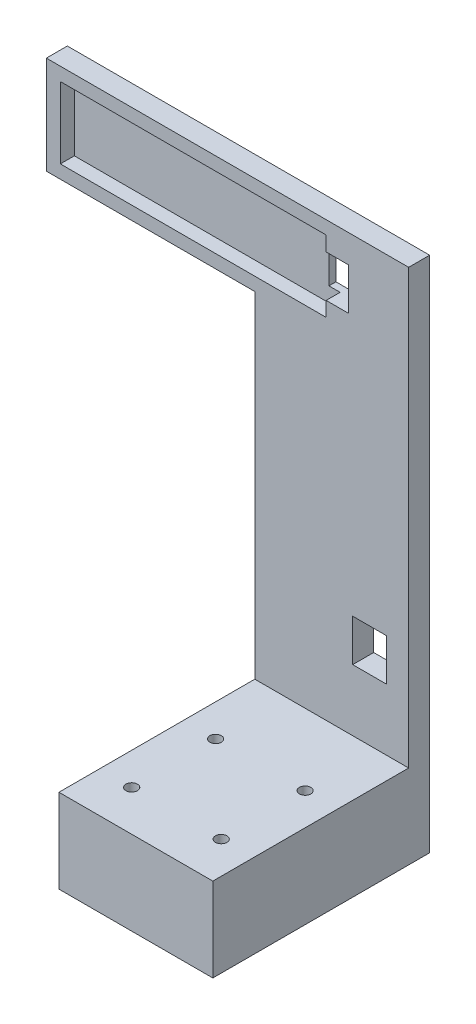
from build123d import *

# Parameters (mm, degrees)
SKETCH1_W             = 55
SKETCH1_H             = 150
BOSS_EXTRUDE1_DEPTH   = 7.5
SKETCH2_W             = 95
SKETCH2_H             = 25.5
CUT_EXTRUDE1_DEPTH    = 5
SKETCH3_W             = 55
SKETCH3_H             = 30
BOSS_EXTRUDE2_DEPTH   = 70
SKETCH5_R             = 2.05
CUT_EXTRUDE2_DEPTH    = 189.630591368
SKETCH6_W             = 45
SKETCH6_H             = 65
CUT_EXTRUDE3_DEPTH    = 25
SKETCH7_W             = 12
SKETCH7_H             = 15
CUT_EXTRUDE4_DEPTH    = 212.365205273
SKETCH8_R             = 1.55
CUT_EXTRUDE5_DEPTH    = 4
CROQUIS2_W            = 0.542735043
CROQUIS2_H            = 5.427350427
CROQUIS2_W_2          = 0.542735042
CROQUIS2_H_2          = 3.86698718
CORTAR_EXTRUIR1_DEPTH = 2


with BuildPart() as part:
    # Sketch1 → Boss-Extrude1 (new body)
    with BuildSketch(Plane.XY):
        Polygon((-74.5, 150), (0, 150), (55, 150), (55, 185), (-74.5, 185), align=None)
        with Locations((27.5, 75)):
            Rectangle(SKETCH1_W, SKETCH1_H)
    extrude(amount=BOSS_EXTRUDE1_DEPTH)

    # Sketch2 → Cut-Extrude1 (cut)
    with BuildSketch(Plane.XY.offset(7.5)):
        with Locations((-22, 167.5)):
            Rectangle(SKETCH2_W, SKETCH2_H)
    extrude(amount=-CUT_EXTRUDE1_DEPTH, mode=Mode.SUBTRACT)

    # Sketch3 → Boss-Extrude2 (add)
    with BuildSketch(Plane.XY.offset(7.5)):
        with Locations((27.5, 15)):
            Rectangle(SKETCH3_W, SKETCH3_H)
    extrude(amount=BOSS_EXTRUDE2_DEPTH)

    # Sketch5 → Cut-Extrude2 (cut, through all)
    with BuildSketch(Plane(origin=(0, 30, 0), x_dir=(1, 0, 0), z_dir=(0, 1, 0))):
        with Locations(Location((11.5, -33, 0), (0, 0, 270))):
            Circle(SKETCH5_R)
        with Locations(Location((11.5, -63, 0), (0, 0, 270))):
            Circle(SKETCH5_R)
        with Locations(Location((43.5, -63, 0), (0, 0, 270))):
            Circle(SKETCH5_R)
        with Locations(Location((43.5, -33, 0), (0, 0, 270))):
            Circle(SKETCH5_R)
    extrude(amount=-CUT_EXTRUDE2_DEPTH, mode=Mode.SUBTRACT)

    # Sketch6 → Cut-Extrude3 (cut)
    with BuildSketch(Plane.XZ):
        with Locations((27.5, 40)):
            Rectangle(SKETCH6_W, SKETCH6_H)
    extrude(amount=-CUT_EXTRUDE3_DEPTH, mode=Mode.SUBTRACT)

    # Sketch7 → Cut-Extrude4 (cut, through all)
    with BuildSketch(Plane.XY.offset(7.5)):
        with Locations((27.5, 167.5)):
            Rectangle(SKETCH7_W, SKETCH7_H)
        with Locations((41, 59.5)):
            Rectangle(SKETCH7_W, SKETCH7_H)
    extrude(amount=-CUT_EXTRUDE4_DEPTH, mode=Mode.SUBTRACT)

    # Sketch8 → Cut-Extrude5 (cut)
    with BuildSketch(Plane(origin=(0, 0, 0), x_dir=(-1, 0, 0), z_dir=(0, 0, -1))):
        with Locations((-52, 133.25)):
            Circle(SKETCH8_R)
        with Locations((-3, 132.25)):
            Circle(SKETCH8_R)
        with Locations((-18.5, 82.25)):
            Circle(SKETCH8_R)
        with Locations((-46.5, 82.25)):
            Circle(SKETCH8_R)
    extrude(amount=-CUT_EXTRUDE5_DEPTH, mode=Mode.SUBTRACT)

    # Croquis2 → Cortar-Extruir1 (cut)
    # profile 1 of 24: a face of its own
    with BuildSketch(Plane(origin=(0, 0, 0), x_dir=(-1, 0, 0), z_dir=(0, 0, -1))):
        Polygon((69.370568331, 176.166932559), (72.559136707, 176.166932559), (70.165590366, 172.774838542), (72.491294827, 172.774838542), (72.491294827, 172.29994538), (69.16704269, 172.29994538), (71.560589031, 175.692039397), (69.370568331, 175.692039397), align=None)
    # profile 2 of 24: a face of its own
    with BuildSketch(Plane(origin=(0, 0, 0), x_dir=(-1, 0, 0), z_dir=(0, 0, -1))):
        with BuildLine():
            Line((67.617915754, 173.521099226), (68.074788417, 173.299553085))
            add(Edge.make_bspline(
                [(68.074788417, 173.299553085), (68.037763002, 173.239759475), (67.96532167, 173.122771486), (67.839730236, 172.964143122), (67.709073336, 172.820258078), (67.566428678, 172.696931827), (67.41599046, 172.589255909), (67.256948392, 172.495514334), (67.089024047, 172.414636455), (66.911416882, 172.347636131), (66.723413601, 172.295436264), (66.524084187, 172.258696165), (66.312835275, 172.236103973), (66.167853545, 172.233458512), (66.093593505, 172.232103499)],
                knots=[0, 0, 0, 0, 1.069421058, 2.092354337, 3.074079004, 4.023050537, 4.955686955, 5.886197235, 6.82897851, 7.788750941, 8.771138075, 9.794142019, 10.87015348, 12, 12, 12, 12], degree=3))
            add(Edge.make_bspline(
                [(66.093593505, 172.232103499), (66.011173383, 172.233811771), (65.850757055, 172.237136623), (65.616983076, 172.266547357), (65.397048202, 172.313408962), (65.190723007, 172.380769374), (64.997977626, 172.466241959), (64.819513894, 172.572527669), (64.654169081, 172.69651105), (64.506018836, 172.839936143), (64.373621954, 172.994212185), (64.255884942, 173.153939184), (64.158160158, 173.320631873), (64.077075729, 173.491417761), (64.014021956, 173.667172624), (63.969690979, 173.847988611), (63.94067771, 174.033566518), (63.937854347, 174.159481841), (63.936433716, 174.222838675)],
                knots=[0, 0, 0, 0, 1.205491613, 2.346278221, 3.441449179, 4.491059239, 5.516244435, 6.519929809, 7.523934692, 8.53314391, 9.53017636, 10.496012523, 11.432326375, 12.352762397, 13.258695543, 14.158990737, 15.073659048, 16, 16, 16, 16], degree=3))
            add(Edge.make_bspline(
                [(63.936433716, 174.222838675), (63.937736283, 174.282282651), (63.940320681, 174.400224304), (63.964752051, 174.574352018), (64.002519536, 174.744137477), (64.057128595, 174.908592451), (64.125929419, 175.068641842), (64.211980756, 175.222581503), (64.311013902, 175.373235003), (64.388831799, 175.466610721), (64.428287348, 175.513954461)],
                knots=[0, 0, 0, 0, 1.009393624, 2.002718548, 2.981368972, 3.96092115, 4.942292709, 5.936433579, 6.953722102, 8, 8, 8, 8], degree=3))
            add(Edge.make_bspline(
                [(64.428287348, 175.513954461), (64.481187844, 175.571299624), (64.585811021, 175.684713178), (64.761625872, 175.833040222), (64.952471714, 175.956478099), (65.155413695, 176.059234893), (65.372544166, 176.137128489), (65.601624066, 176.195394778), (65.844623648, 176.227733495), (66.010820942, 176.232393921), (66.095713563, 176.234774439)],
                knots=[0, 0, 0, 0, 0.996914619, 1.971633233, 2.931517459, 3.89730572, 4.873478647, 5.874999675, 6.914562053, 8, 8, 8, 8], degree=3))
            add(Edge.make_bspline(
                [(66.095713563, 176.234774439), (66.183122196, 176.232728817), (66.354475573, 176.228718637), (66.604515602, 176.191560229), (66.841278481, 176.132589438), (67.064557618, 176.049692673), (67.27397919, 175.942032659), (67.468729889, 175.80892421), (67.651937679, 175.65428631), (67.759538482, 175.534384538), (67.814021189, 175.473673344)],
                knots=[0, 0, 0, 0, 1.078642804, 2.114540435, 3.113387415, 4.086610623, 5.048542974, 6.012925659, 6.993862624, 8, 8, 8, 8], degree=3))
            add(Edge.make_bspline(
                [(67.814021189, 175.473673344), (67.850583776, 175.428027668), (67.923323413, 175.337217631), (68.016941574, 175.189418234), (68.096543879, 175.033673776), (68.161370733, 174.869188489), (68.212375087, 174.696779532), (68.249096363, 174.515900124), (68.273286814, 174.326658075), (68.276617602, 174.197473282), (68.278314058, 174.131676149)],
                knots=[0, 0, 0, 0, 0.967473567, 1.924745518, 2.889953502, 3.858752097, 4.846970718, 5.862117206, 6.911121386, 8, 8, 8, 8], degree=3))
            Line((68.278314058, 174.131676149), (64.479168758, 174.131676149))
            add(Edge.make_bspline(
                [(64.479168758, 174.131676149), (64.481806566, 174.080719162), (64.486998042, 173.980430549), (64.510056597, 173.833480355), (64.548749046, 173.694129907), (64.599649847, 173.56190917), (64.663803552, 173.436739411), (64.741409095, 173.318558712), (64.833596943, 173.207786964), (64.937627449, 173.104848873), (65.052085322, 173.011687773), (65.173876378, 172.930192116), (65.302069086, 172.860333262), (65.437177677, 172.804295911), (65.578790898, 172.760558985), (65.727224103, 172.730285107), (65.881760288, 172.710471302), (65.987175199, 172.708165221), (66.040592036, 172.706996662)],
                knots=[0, 0, 0, 0, 1.039073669, 2.045004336, 3.02296125, 3.980111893, 4.926619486, 5.882957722, 6.854402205, 7.857159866, 8.859995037, 9.85624635, 10.83864398, 11.829261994, 12.831114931, 13.853244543, 14.912175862, 16, 16, 16, 16], degree=3))
            add(Edge.make_bspline(
                [(66.040592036, 172.706996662), (66.092930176, 172.707951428), (66.197530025, 172.709859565), (66.353134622, 172.727257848), (66.506415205, 172.756160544), (66.655876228, 172.795121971), (66.79896558, 172.842902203), (66.931516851, 172.900479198), (67.053396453, 172.964082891), (67.167251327, 173.036963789), (67.278048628, 173.125799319), (67.387838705, 173.237321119), (67.504709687, 173.369187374), (67.578749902, 173.468542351), (67.617915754, 173.521099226)],
                knots=[0, 0, 0, 0, 1.015876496, 2.030269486, 3.035340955, 4.042003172, 5.026901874, 5.961011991, 6.844769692, 7.693457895, 8.581624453, 9.595460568, 10.728044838, 12, 12, 12, 12], degree=3))
        make_face()
        with BuildLine():
            add(Edge.make_bspline(
                [(67.735579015, 174.606569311), (67.716397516, 174.669578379), (67.679419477, 174.791047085), (67.604613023, 174.95955749), (67.517921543, 175.108521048), (67.41625915, 175.238365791), (67.299770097, 175.35185072), (67.167950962, 175.454030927), (67.0177494, 175.542217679), (66.853244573, 175.618636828), (66.679172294, 175.682636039), (66.497353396, 175.726401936), (66.311499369, 175.755680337), (66.185575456, 175.758475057), (66.122214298, 175.759881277)],
                knots=[0, 0, 0, 0, 1.104466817, 2.129188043, 3.086148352, 3.990031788, 4.887356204, 5.808921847, 6.782131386, 7.80343277, 8.850085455, 9.888441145, 10.937526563, 12, 12, 12, 12], degree=3))
            add(Edge.make_bspline(
                [(66.122214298, 175.759881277), (66.070582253, 175.758948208), (65.968444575, 175.757102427), (65.818064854, 175.73988868), (65.673557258, 175.711064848), (65.534141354, 175.672151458), (65.401374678, 175.619559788), (65.272621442, 175.558312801), (65.150544, 175.483770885), (65.074101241, 175.426255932), (65.035684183, 175.397351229)],
                knots=[0, 0, 0, 0, 1.060590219, 2.098042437, 3.104680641, 4.085971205, 5.067476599, 6.035109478, 7.012525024, 8, 8, 8, 8], degree=3))
            add(Edge.make_bspline(
                [(65.035684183, 175.397351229), (65.008336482, 175.374560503), (64.95312634, 175.328550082), (64.878514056, 175.248907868), (64.806665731, 175.163509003), (64.742040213, 175.067780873), (64.681796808, 174.964375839), (64.627168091, 174.852424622), (64.574982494, 174.733526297), (64.547377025, 174.649585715), (64.533230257, 174.606569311)],
                knots=[0, 0, 0, 0, 0.898025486, 1.812953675, 2.750779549, 3.713399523, 4.724846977, 5.770194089, 6.857307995, 8, 8, 8, 8], degree=3))
            Line((64.533230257, 174.606569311), (67.735579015, 174.606569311))
        make_face(mode=Mode.SUBTRACT)
    # profile 3 of 24: a face of its own
    with BuildSketch(Plane(origin=(0, 0, 0), x_dir=(-1, 0, 0), z_dir=(0, 0, -1))):
        with BuildLine():
            Line((58.773666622, 176.166932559), (59.316401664, 176.166932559))
            Line((59.316401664, 176.166932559), (59.316401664, 175.469433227))
            add(Edge.make_bspline(
                [(59.316401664, 175.469433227), (59.369603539, 175.53271904), (59.473019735, 175.655736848), (59.644418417, 175.817498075), (59.825958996, 175.949581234), (60.015335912, 176.05648896), (60.214118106, 176.135410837), (60.420360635, 176.193566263), (60.6353415, 176.22792373), (60.781594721, 176.232473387), (60.855564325, 176.234774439)],
                knots=[0, 0, 0, 0, 1.111920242, 2.161400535, 3.161851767, 4.126104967, 5.07964332, 6.032517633, 7.00491838, 8, 8, 8, 8], degree=3))
            add(Edge.make_bspline(
                [(60.855564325, 176.234774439), (60.930296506, 176.23213322), (61.076648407, 176.226960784), (61.289979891, 176.186112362), (61.489674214, 176.116663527), (61.674505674, 176.021163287), (61.840942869, 175.902371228), (61.986967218, 175.76399039), (62.108061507, 175.604789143), (62.1887897, 175.456599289), (62.243191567, 175.325733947), (62.27549191, 175.212994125), (62.306235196, 175.088447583), (62.328067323, 174.950386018), (62.347990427, 174.799919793), (62.359431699, 174.636024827), (62.368818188, 174.459687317), (62.369127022, 174.337690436), (62.36928628, 174.274780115)],
                knots=[0, 0, 0, 0, 1.266569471, 2.480388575, 3.666522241, 4.840213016, 5.995671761, 7.122871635, 8.238500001, 9.37270005, 9.9746134, 10.638003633, 11.358784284, 12.148732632, 13.006310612, 13.931773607, 14.933474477, 16, 16, 16, 16], degree=3))
            Line((62.36928628, 174.274780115), (62.36928628, 172.29994538))
            Line((62.36928628, 172.29994538), (61.826551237, 172.29994538))
            Line((61.826551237, 172.29994538), (61.826551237, 174.118955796))
            add(Edge.make_bspline(
                [(61.826551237, 174.118955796), (61.826769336, 174.171605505), (61.827186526, 174.27231652), (61.824356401, 174.416470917), (61.822644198, 174.547219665), (61.819690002, 174.664198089), (61.814940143, 174.767339), (61.811609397, 174.85684156), (61.804978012, 174.932419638), (61.800106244, 174.978292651), (61.797930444, 174.998780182)],
                knots=[0, 0, 0, 0, 1.434747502, 2.74445729, 3.92900273, 4.998231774, 5.933055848, 6.742823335, 7.438527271, 8, 8, 8, 8], degree=3))
            add(Edge.make_bspline(
                [(61.797930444, 174.998780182), (61.793481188, 175.029605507), (61.78481931, 175.08961671), (61.763846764, 175.176105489), (61.734375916, 175.256263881), (61.700452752, 175.33164717), (61.657061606, 175.400307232), (61.607316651, 175.462893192), (61.550388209, 175.519775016), (61.464797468, 175.587887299), (61.342076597, 175.658493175), (61.17550602, 175.71775933), (60.989294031, 175.754262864), (60.858215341, 175.757955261), (60.789842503, 175.759881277)],
                knots=[0, 0, 0, 0, 0.798662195, 1.554847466, 2.277311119, 2.986925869, 3.670959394, 4.354632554, 5.033966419, 5.730377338, 7.155873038, 8.641058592, 10.247919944, 12, 12, 12, 12], degree=3))
            add(Edge.make_bspline(
                [(60.789842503, 175.759881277), (60.749169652, 175.759168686), (60.668994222, 175.757764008), (60.550181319, 175.743496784), (60.434826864, 175.719848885), (60.321797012, 175.689038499), (60.21365733, 175.644881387), (60.106759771, 175.59646468), (60.005150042, 175.534405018), (59.905859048, 175.46684983), (59.813924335, 175.390609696), (59.727987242, 175.311149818), (59.651695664, 175.226085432), (59.583648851, 175.136519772), (59.522871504, 175.043259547), (59.470607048, 174.945083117), (59.427013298, 174.842515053), (59.404860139, 174.771433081), (59.393783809, 174.735892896)],
                knots=[0, 0, 0, 0, 1.051784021, 2.073305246, 3.089701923, 4.096642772, 5.098092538, 6.108057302, 7.128555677, 8.173166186, 9.212444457, 10.214769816, 11.198544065, 12.163800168, 13.122150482, 14.074905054, 15.037474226, 16, 16, 16, 16], degree=3))
            add(Edge.make_bspline(
                [(59.393783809, 174.735892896), (59.38748338, 174.709808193), (59.373775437, 174.6530553), (59.358364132, 174.559921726), (59.34635989, 174.451925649), (59.334293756, 174.329728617), (59.326045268, 174.192539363), (59.321578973, 174.040882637), (59.316523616, 173.87447329), (59.316443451, 173.758550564), (59.316401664, 173.698124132)],
                knots=[0, 0, 0, 0, 0.617412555, 1.343314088, 2.170381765, 3.117878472, 4.168869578, 5.332398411, 6.609473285, 8, 8, 8, 8], degree=3))
            Line((59.316401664, 173.698124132), (59.316401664, 172.29994538))
            Line((59.316401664, 172.29994538), (58.773666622, 172.29994538))
            Line((58.773666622, 172.29994538), (58.773666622, 176.166932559))
        make_face()
    # profile 4 of 24: a face of its own
    with BuildSketch(Plane(origin=(0, 0, 0), x_dir=(-1, 0, 0), z_dir=(0, 0, -1))):
        with BuildLine():
            Line((61.690867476, 177.659453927), (61.962234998, 177.31176429))
            add(Edge.make_bspline(
                [(61.962234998, 177.31176429), (61.919055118, 177.281666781), (61.837093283, 177.224537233), (61.717125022, 177.150264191), (61.606982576, 177.092128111), (61.505481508, 177.048010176), (61.407153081, 177.017853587), (61.309299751, 176.996593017), (61.208914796, 176.983388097), (61.141105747, 176.981825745), (61.106791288, 176.981035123)],
                knots=[0, 0, 0, 0, 1.351868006, 2.566046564, 3.621582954, 4.548779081, 5.404257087, 6.258771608, 7.118859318, 8, 8, 8, 8], degree=3))
            add(Edge.make_bspline(
                [(61.106791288, 176.981035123), (61.061115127, 176.982445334), (60.968125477, 176.985316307), (60.828126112, 177.009852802), (60.686139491, 177.049100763), (60.593422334, 177.086132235), (60.546035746, 177.105058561)],
                knots=[0, 0, 0, 0, 0.947532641, 1.929030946, 2.941553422, 4, 4, 4, 4], degree=3))
            add(Edge.make_bspline(
                [(60.546035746, 177.105058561), (60.508990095, 177.121099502), (60.442134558, 177.150048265), (60.352698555, 177.186641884), (60.285704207, 177.213736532), (60.247531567, 177.22469851), (60.232267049, 177.229081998)],
                knots=[0, 0, 0, 0, 1.434685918, 2.589148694, 3.435827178, 4, 4, 4, 4], degree=3))
            add(Edge.make_bspline(
                [(60.232267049, 177.229081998), (60.200946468, 177.236140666), (60.136051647, 177.250765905), (60.069521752, 177.251844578), (60.035101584, 177.252402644)],
                knots=[0, 0, 0, 0, 0.965272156, 2, 2, 2, 2], degree=3))
            add(Edge.make_bspline(
                [(60.035101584, 177.252402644), (59.991867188, 177.250495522), (59.906618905, 177.246735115), (59.799879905, 177.223025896), (59.711418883, 177.189608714), (59.632316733, 177.152760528), (59.538457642, 177.106375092), (59.472734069, 177.069038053), (59.437245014, 177.048877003)],
                knots=[0, 0, 0, 0, 1.21610364, 2.397876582, 3.055264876, 3.873878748, 4.851948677, 6, 6, 6, 6], degree=3))
            Line((59.437245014, 177.048877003), (59.180717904, 177.41352711))
            add(Edge.make_bspline(
                [(59.180717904, 177.41352711), (59.21003017, 177.438360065), (59.268214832, 177.487653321), (59.36135958, 177.553105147), (59.461606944, 177.605984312), (59.565653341, 177.650700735), (59.675605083, 177.684450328), (59.78985649, 177.710720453), (59.910075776, 177.723661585), (59.991617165, 177.726072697), (60.032981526, 177.727295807)],
                knots=[0, 0, 0, 0, 0.991279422, 1.967683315, 2.930537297, 3.911190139, 4.886017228, 5.894882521, 6.932114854, 8, 8, 8, 8], degree=3))
            add(Edge.make_bspline(
                [(60.032981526, 177.727295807), (60.075488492, 177.72547803), (60.165066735, 177.721647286), (60.304652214, 177.694300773), (60.455558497, 177.650494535), (60.557992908, 177.610489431), (60.611757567, 177.589491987)],
                knots=[0, 0, 0, 0, 0.852167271, 1.795838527, 2.843103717, 4, 4, 4, 4], degree=3))
            add(Edge.make_bspline(
                [(60.611757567, 177.589491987), (60.662359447, 177.569241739), (60.756887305, 177.531412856), (60.892775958, 177.490582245), (61.011273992, 177.46192572), (61.085462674, 177.457814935), (61.11951164, 177.455928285)],
                knots=[0, 0, 0, 0, 1.238485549, 2.313577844, 3.226014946, 4, 4, 4, 4], degree=3))
            add(Edge.make_bspline(
                [(61.11951164, 177.455928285), (61.137567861, 177.456606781), (61.175670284, 177.45803855), (61.235219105, 177.468371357), (61.299689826, 177.484260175), (61.368701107, 177.506756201), (61.442384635, 177.536057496), (61.521406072, 177.570702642), (61.605206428, 177.612138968), (61.661663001, 177.643322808), (61.690867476, 177.659453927)],
                knots=[0, 0, 0, 0, 0.707737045, 1.493474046, 2.363696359, 3.309985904, 4.336436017, 5.4715575, 6.692059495, 8, 8, 8, 8], degree=3))
        make_face()
    # profile 5 of 24: a face of its own
    with BuildSketch(Plane(origin=(0, 0, 0), x_dir=(-1, 0, 0), z_dir=(0, 0, -1))):
        with BuildLine():
            Line((53.407373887, 176.166932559), (53.950108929, 176.166932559))
            Line((53.950108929, 176.166932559), (53.950108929, 174.373362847))
            add(Edge.make_bspline(
                [(53.950108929, 174.373362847), (53.950147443, 174.320709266), (53.950221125, 174.219976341), (53.955301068, 174.075122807), (53.959792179, 173.942894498), (53.967861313, 173.823338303), (53.98028512, 173.716741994), (53.991863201, 173.622780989), (54.007703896, 173.541363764), (54.021215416, 173.492058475), (54.027491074, 173.469157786)],
                knots=[0, 0, 0, 0, 1.388489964, 2.656355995, 3.822101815, 4.877729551, 5.815201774, 6.652054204, 7.373923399, 8, 8, 8, 8], degree=3))
            add(Edge.make_bspline(
                [(54.027491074, 173.469157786), (54.037528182, 173.44031076), (54.057492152, 173.382933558), (54.097148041, 173.301544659), (54.142995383, 173.224651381), (54.195206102, 173.152366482), (54.2533676, 173.084271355), (54.318756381, 173.021651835), (54.38979847, 172.962727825), (54.495037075, 172.892531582), (54.638988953, 172.81713781), (54.827621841, 172.752766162), (55.032205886, 172.713642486), (55.17355655, 172.709259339), (55.246524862, 172.706996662)],
                knots=[0, 0, 0, 0, 0.713237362, 1.418640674, 2.111118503, 2.803202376, 3.499999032, 4.200747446, 4.916513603, 5.65395606, 7.153437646, 8.699331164, 10.2961224, 12, 12, 12, 12], degree=3))
            add(Edge.make_bspline(
                [(55.246524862, 172.706996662), (55.319120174, 172.709375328), (55.459666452, 172.713980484), (55.661874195, 172.751196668), (55.846871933, 172.814249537), (56.013266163, 172.90104429), (56.159626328, 173.008005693), (56.281410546, 173.133444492), (56.381216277, 173.273797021), (56.42535955, 173.378427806), (56.447538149, 173.430996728)],
                knots=[0, 0, 0, 0, 1.164572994, 2.25464146, 3.285868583, 4.290364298, 5.255624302, 6.182035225, 7.08661253, 8, 8, 8, 8], degree=3))
            add(Edge.make_bspline(
                [(56.447538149, 173.430996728), (56.45431415, 173.452088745), (56.469257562, 173.498603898), (56.483912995, 173.578019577), (56.497610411, 173.672417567), (56.509238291, 173.782734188), (56.517102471, 173.908644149), (56.523388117, 174.050004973), (56.527857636, 174.206556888), (56.528017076, 174.316117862), (56.528100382, 174.373362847)],
                knots=[0, 0, 0, 0, 0.559844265, 1.234649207, 2.038502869, 2.973158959, 4.039089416, 5.228949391, 6.552141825, 8, 8, 8, 8], degree=3))
            Line((56.528100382, 174.373362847), (56.528100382, 176.166932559))
            Line((56.528100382, 176.166932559), (57.070835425, 176.166932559))
            Line((57.070835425, 176.166932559), (57.070835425, 174.28432038))
            add(Edge.make_bspline(
                [(57.070835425, 174.28432038), (57.070266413, 174.220352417), (57.069162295, 174.096228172), (57.059488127, 173.915880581), (57.044069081, 173.747836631), (57.021827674, 173.591789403), (56.993428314, 173.448506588), (56.960105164, 173.316726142), (56.918617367, 173.197724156), (56.87089995, 173.0894521), (56.815414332, 172.991136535), (56.75643017, 172.897848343), (56.689101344, 172.811464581), (56.616947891, 172.728913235), (56.537514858, 172.652623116), (56.450773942, 172.583076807), (56.359819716, 172.516311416), (56.260894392, 172.457326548), (56.155642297, 172.40435426), (56.044456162, 172.357122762), (55.926283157, 172.319818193), (55.802186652, 172.287457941), (55.671535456, 172.262341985), (55.534203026, 172.244423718), (55.390865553, 172.233607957), (55.293185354, 172.232611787), (55.243344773, 172.232103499)],
                knots=[0, 0, 0, 0, 1.455335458, 2.823951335, 4.107895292, 5.293730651, 6.408430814, 7.430196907, 8.383639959, 9.272568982, 10.118238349, 10.950037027, 11.781369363, 12.607241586, 13.443070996, 14.283065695, 15.135396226, 16.008145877, 16.899797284, 17.815056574, 18.753192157, 19.716447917, 20.731836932, 21.777889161, 22.866184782, 24, 24, 24, 24], degree=3))
            add(Edge.make_bspline(
                [(55.243344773, 172.232103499), (55.193149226, 172.23259541), (55.095112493, 172.23355616), (54.951092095, 172.244545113), (54.813689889, 172.262058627), (54.68248732, 172.287917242), (54.557556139, 172.319648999), (54.438252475, 172.356882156), (54.326629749, 172.404691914), (54.220601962, 172.456891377), (54.121420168, 172.517094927), (54.02832143, 172.582257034), (53.942149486, 172.6538354), (53.861986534, 172.730306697), (53.789007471, 172.813245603), (53.72197412, 172.90141589), (53.661507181, 172.995030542), (53.60644655, 173.094867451), (53.557960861, 173.204138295), (53.518517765, 173.326287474), (53.483282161, 173.460267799), (53.456555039, 173.607825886), (53.434220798, 173.767280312), (53.418637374, 173.939910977), (53.409048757, 174.125205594), (53.407944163, 174.253213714), (53.407373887, 174.319301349)],
                knots=[0, 0, 0, 0, 1.127190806, 2.201512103, 3.242001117, 4.236561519, 5.202823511, 6.136465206, 7.039972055, 7.92726535, 8.788808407, 9.64312027, 10.477364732, 11.302461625, 12.128931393, 12.955896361, 13.78798637, 14.6297467, 15.514516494, 16.468181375, 17.509547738, 18.624010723, 19.833909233, 21.125071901, 22.515741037, 24, 24, 24, 24], degree=3))
            Line((53.407373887, 174.319301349), (53.407373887, 176.166932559))
        make_face()
    # profile 6 of 24: a face of its own
    with BuildSketch(Plane(origin=(0, 0, 0), x_dir=(-1, 0, 0), z_dir=(0, 0, -1))):
        Polygon((55.515772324, 177.862979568), (56.324574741, 177.862979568), (55.21578401, 176.777509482), (54.696369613, 176.777509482), align=None)
    # profile 7 of 24: a face of its own
    with BuildSketch(Plane(origin=(0, 0, 0), x_dir=(-1, 0, 0), z_dir=(0, 0, -1))):
        Polygon((47.159136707, 172.29994538), (47.159136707, 177.591612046), (47.27361988, 177.591612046), (51.161807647, 173.493538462), (51.161807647, 177.591612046), (51.70454269, 177.591612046), (51.70454269, 172.29994538), (51.580519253, 172.29994538), (47.70187175, 176.38741867), (47.70187175, 172.29994538), align=None)
    # profile 8 of 24: a face of its own
    with BuildSketch(Plane(origin=(0, 0, 0), x_dir=(-1, 0, 0), z_dir=(0, 0, -1))):
        with Locations((42.600162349, 175.013620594)):
            Rectangle(CROQUIS2_W, CROQUIS2_H)
    # profile 9 of 24: a face of its own
    with BuildSketch(Plane(origin=(0, 0, 0), x_dir=(-1, 0, 0), z_dir=(0, 0, -1))):
        with Locations((40.55812175, 175.013620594)):
            Rectangle(CROQUIS2_W_2, CROQUIS2_H)
    # profile 10 of 24: a face of its own
    with BuildSketch(Plane(origin=(0, 0, 0), x_dir=(-1, 0, 0), z_dir=(0, 0, -1))):
        with BuildLine():
            Line((38.194892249, 173.521099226), (38.651764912, 173.299553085))
            add(Edge.make_bspline(
                [(38.651764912, 173.299553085), (38.614739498, 173.239759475), (38.542298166, 173.122771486), (38.416706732, 172.964143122), (38.286049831, 172.820258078), (38.143405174, 172.696931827), (37.992966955, 172.589255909), (37.833924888, 172.495514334), (37.666000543, 172.414636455), (37.488393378, 172.347636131), (37.300390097, 172.295436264), (37.101060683, 172.258696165), (36.889811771, 172.236103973), (36.744830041, 172.233458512), (36.67057, 172.232103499)],
                knots=[0, 0, 0, 0, 1.069421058, 2.092354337, 3.074079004, 4.023050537, 4.955686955, 5.886197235, 6.82897851, 7.788750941, 8.771138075, 9.794142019, 10.87015348, 12, 12, 12, 12], degree=3))
            add(Edge.make_bspline(
                [(36.67057, 172.232103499), (36.588149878, 172.233811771), (36.427733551, 172.237136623), (36.193959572, 172.266547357), (35.974024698, 172.313408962), (35.767699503, 172.380769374), (35.574954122, 172.466241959), (35.39649039, 172.572527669), (35.231145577, 172.69651105), (35.082995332, 172.839936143), (34.95059845, 172.994212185), (34.832861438, 173.153939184), (34.735136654, 173.320631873), (34.654052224, 173.491417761), (34.590998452, 173.667172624), (34.546667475, 173.847988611), (34.517654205, 174.033566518), (34.514830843, 174.159481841), (34.513410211, 174.222838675)],
                knots=[0, 0, 0, 0, 1.205491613, 2.346278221, 3.441449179, 4.491059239, 5.516244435, 6.519929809, 7.523934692, 8.53314391, 9.53017636, 10.496012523, 11.432326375, 12.352762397, 13.258695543, 14.158990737, 15.073659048, 16, 16, 16, 16], degree=3))
            add(Edge.make_bspline(
                [(34.513410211, 174.222838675), (34.514712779, 174.282282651), (34.517297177, 174.400224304), (34.541728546, 174.574352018), (34.579496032, 174.744137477), (34.634105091, 174.908592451), (34.702905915, 175.068641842), (34.788957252, 175.222581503), (34.887990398, 175.373235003), (34.965808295, 175.466610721), (35.005263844, 175.513954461)],
                knots=[0, 0, 0, 0, 1.009393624, 2.002718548, 2.981368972, 3.96092115, 4.942292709, 5.936433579, 6.953722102, 8, 8, 8, 8], degree=3))
            add(Edge.make_bspline(
                [(35.005263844, 175.513954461), (35.058164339, 175.571299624), (35.162787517, 175.684713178), (35.338602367, 175.833040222), (35.529448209, 175.956478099), (35.732390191, 176.059234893), (35.949520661, 176.137128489), (36.178600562, 176.195394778), (36.421600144, 176.227733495), (36.587797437, 176.232393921), (36.672690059, 176.234774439)],
                knots=[0, 0, 0, 0, 0.996914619, 1.971633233, 2.931517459, 3.89730572, 4.873478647, 5.874999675, 6.914562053, 8, 8, 8, 8], degree=3))
            add(Edge.make_bspline(
                [(36.672690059, 176.234774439), (36.760098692, 176.232728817), (36.931452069, 176.228718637), (37.181492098, 176.191560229), (37.418254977, 176.132589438), (37.641534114, 176.049692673), (37.850955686, 175.942032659), (38.045706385, 175.80892421), (38.228914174, 175.65428631), (38.336514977, 175.534384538), (38.390997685, 175.473673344)],
                knots=[0, 0, 0, 0, 1.078642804, 2.114540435, 3.113387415, 4.086610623, 5.048542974, 6.012925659, 6.993862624, 8, 8, 8, 8], degree=3))
            add(Edge.make_bspline(
                [(38.390997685, 175.473673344), (38.427560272, 175.428027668), (38.500299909, 175.337217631), (38.59391807, 175.189418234), (38.673520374, 175.033673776), (38.738347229, 174.869188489), (38.789351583, 174.696779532), (38.826072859, 174.515900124), (38.85026331, 174.326658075), (38.853594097, 174.197473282), (38.855290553, 174.131676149)],
                knots=[0, 0, 0, 0, 0.967473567, 1.924745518, 2.889953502, 3.858752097, 4.846970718, 5.862117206, 6.911121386, 8, 8, 8, 8], degree=3))
            Line((38.855290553, 174.131676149), (35.056145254, 174.131676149))
            add(Edge.make_bspline(
                [(35.056145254, 174.131676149), (35.058783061, 174.080719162), (35.063974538, 173.980430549), (35.087033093, 173.833480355), (35.125725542, 173.694129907), (35.176626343, 173.56190917), (35.240780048, 173.436739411), (35.318385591, 173.318558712), (35.410573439, 173.207786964), (35.514603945, 173.104848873), (35.629061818, 173.011687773), (35.750852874, 172.930192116), (35.879045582, 172.860333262), (36.014154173, 172.804295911), (36.155767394, 172.760558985), (36.304200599, 172.730285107), (36.458736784, 172.710471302), (36.564151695, 172.708165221), (36.617568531, 172.706996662)],
                knots=[0, 0, 0, 0, 1.039073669, 2.045004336, 3.02296125, 3.980111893, 4.926619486, 5.882957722, 6.854402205, 7.857159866, 8.859995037, 9.85624635, 10.83864398, 11.829261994, 12.831114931, 13.853244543, 14.912175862, 16, 16, 16, 16], degree=3))
            add(Edge.make_bspline(
                [(36.617568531, 172.706996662), (36.669906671, 172.707951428), (36.774506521, 172.709859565), (36.930111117, 172.727257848), (37.0833917, 172.756160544), (37.232852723, 172.795121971), (37.375942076, 172.842902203), (37.508493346, 172.900479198), (37.630372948, 172.964082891), (37.744227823, 173.036963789), (37.855025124, 173.125799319), (37.9648152, 173.237321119), (38.081686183, 173.369187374), (38.155726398, 173.468542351), (38.194892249, 173.521099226)],
                knots=[0, 0, 0, 0, 1.015876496, 2.030269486, 3.035340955, 4.042003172, 5.026901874, 5.961011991, 6.844769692, 7.693457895, 8.581624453, 9.595460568, 10.728044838, 12, 12, 12, 12], degree=3))
        make_face()
        with BuildLine():
            add(Edge.make_bspline(
                [(38.312555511, 174.606569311), (38.293374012, 174.669578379), (38.256395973, 174.791047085), (38.181589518, 174.95955749), (38.094898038, 175.108521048), (37.993235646, 175.238365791), (37.876746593, 175.35185072), (37.744927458, 175.454030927), (37.594725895, 175.542217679), (37.430221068, 175.618636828), (37.25614879, 175.682636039), (37.074329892, 175.726401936), (36.888475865, 175.755680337), (36.762551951, 175.758475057), (36.699190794, 175.759881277)],
                knots=[0, 0, 0, 0, 1.104466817, 2.129188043, 3.086148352, 3.990031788, 4.887356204, 5.808921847, 6.782131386, 7.80343277, 8.850085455, 9.888441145, 10.937526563, 12, 12, 12, 12], degree=3))
            add(Edge.make_bspline(
                [(36.699190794, 175.759881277), (36.647558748, 175.758948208), (36.545421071, 175.757102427), (36.39504135, 175.73988868), (36.250533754, 175.711064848), (36.111117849, 175.672151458), (35.978351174, 175.619559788), (35.849597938, 175.558312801), (35.727520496, 175.483770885), (35.651077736, 175.426255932), (35.612660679, 175.397351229)],
                knots=[0, 0, 0, 0, 1.060590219, 2.098042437, 3.104680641, 4.085971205, 5.067476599, 6.035109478, 7.012525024, 8, 8, 8, 8], degree=3))
            add(Edge.make_bspline(
                [(35.612660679, 175.397351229), (35.585312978, 175.374560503), (35.530102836, 175.328550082), (35.455490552, 175.248907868), (35.383642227, 175.163509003), (35.319016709, 175.067780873), (35.258773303, 174.964375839), (35.204144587, 174.852424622), (35.15195899, 174.733526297), (35.124353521, 174.649585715), (35.110206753, 174.606569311)],
                knots=[0, 0, 0, 0, 0.898025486, 1.812953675, 2.750779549, 3.713399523, 4.724846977, 5.770194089, 6.857307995, 8, 8, 8, 8], degree=3))
            Line((35.110206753, 174.606569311), (38.312555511, 174.606569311))
        make_face(mode=Mode.SUBTRACT)
    # profile 11 of 24: a face of its own
    with BuildSketch(Plane(origin=(0, 0, 0), x_dir=(-1, 0, 0), z_dir=(0, 0, -1))):
        Polygon((29.418484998, 176.166932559), (30.018461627, 176.166932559), (31.420880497, 173.411916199), (32.821179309, 176.166932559), (33.421155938, 176.166932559), (31.453741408, 172.29994538), (31.385899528, 172.29994538), align=None)
    # profile 12 of 24: a face of its own
    with BuildSketch(Plane(origin=(0, 0, 0), x_dir=(-1, 0, 0), z_dir=(0, 0, -1))):
        with BuildLine():
            Line((28.122705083, 176.166932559), (28.122705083, 172.29994538))
            Line((28.122705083, 172.29994538), (27.57997004, 172.29994538))
            Line((27.57997004, 172.29994538), (27.57997004, 172.968823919))
            add(Edge.make_bspline(
                [(27.57997004, 172.968823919), (27.522652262, 172.908053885), (27.409958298, 172.788572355), (27.220645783, 172.636254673), (27.022556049, 172.507272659), (26.813324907, 172.405202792), (26.594082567, 172.327354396), (26.365151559, 172.27300133), (26.126727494, 172.237347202), (25.964262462, 172.233868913), (25.881802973, 172.232103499)],
                knots=[0, 0, 0, 0, 1.048368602, 2.061224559, 3.043775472, 4.012553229, 4.978499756, 5.96037864, 6.964785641, 8, 8, 8, 8], degree=3))
            add(Edge.make_bspline(
                [(25.881802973, 172.232103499), (25.808217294, 172.2339421), (25.663347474, 172.237561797), (25.450146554, 172.266050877), (25.245295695, 172.311136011), (25.048443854, 172.37508181), (24.860251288, 172.458493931), (24.679566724, 172.559039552), (24.507704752, 172.679119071), (24.346284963, 172.815410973), (24.198890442, 172.964975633), (24.068305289, 173.123222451), (23.958269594, 173.290538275), (23.869127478, 173.466460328), (23.798385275, 173.64956959), (23.748606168, 173.840846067), (23.718051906, 174.039875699), (23.714687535, 174.175380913), (23.712982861, 174.244039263)],
                knots=[0, 0, 0, 0, 1.073006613, 2.112452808, 3.131537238, 4.128992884, 5.125875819, 6.129556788, 7.140358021, 8.179037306, 9.206764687, 10.199268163, 11.167014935, 12.12125937, 13.070745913, 14.024558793, 14.999075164, 16, 16, 16, 16], degree=3))
            add(Edge.make_bspline(
                [(23.712982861, 174.244039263), (23.714586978, 174.311301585), (23.71776197, 174.444432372), (23.749957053, 174.639763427), (23.799658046, 174.828208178), (23.869776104, 175.00898322), (23.960755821, 175.181962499), (24.072205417, 175.34706686), (24.202767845, 175.505477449), (24.352771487, 175.65320315), (24.515466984, 175.78930213), (24.68886267, 175.908175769), (24.869681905, 176.0101097), (25.059853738, 176.091440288), (25.257171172, 176.156763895), (25.463140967, 176.20228968), (25.677219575, 176.228948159), (25.822719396, 176.232811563), (25.896643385, 176.234774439)],
                knots=[0, 0, 0, 0, 0.982608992, 1.944855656, 2.885902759, 3.827956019, 4.773021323, 5.737262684, 6.73535209, 7.769099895, 8.810832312, 9.832479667, 10.838491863, 11.840357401, 12.851555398, 13.873006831, 14.919340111, 16, 16, 16, 16], degree=3))
            add(Edge.make_bspline(
                [(25.896643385, 176.234774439), (25.981565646, 176.232614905), (26.147919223, 176.22838461), (26.391451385, 176.192787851), (26.62195437, 176.133370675), (26.840788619, 176.051450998), (27.047658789, 175.944062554), (27.239813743, 175.806728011), (27.420712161, 175.643282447), (27.526008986, 175.516423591), (27.57997004, 175.451412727)],
                knots=[0, 0, 0, 0, 1.056993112, 2.070535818, 3.056509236, 4.015816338, 4.974164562, 5.949479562, 6.949177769, 8, 8, 8, 8], degree=3))
            Line((27.57997004, 175.451412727), (27.57997004, 176.166932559))
            Line((27.57997004, 176.166932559), (28.122705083, 176.166932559))
        make_face()
        with BuildLine():
            add(Edge.make_bspline(
                [(25.919964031, 175.759881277), (25.846318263, 175.757385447), (25.700554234, 175.752445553), (25.486418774, 175.714614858), (25.281168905, 175.651497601), (25.086530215, 175.564587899), (24.904813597, 175.456457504), (24.742799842, 175.324421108), (24.598706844, 175.173651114), (24.477478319, 175.003994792), (24.378030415, 174.822500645), (24.308305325, 174.632339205), (24.263221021, 174.437301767), (24.258223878, 174.30505728), (24.255717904, 174.238739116)],
                knots=[0, 0, 0, 0, 1.058508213, 2.095061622, 3.115540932, 4.138987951, 5.153187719, 6.14659773, 7.134849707, 8.14301248, 9.136422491, 10.100921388, 11.047647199, 12, 12, 12, 12], degree=3))
            add(Edge.make_bspline(
                [(24.255717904, 174.238739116), (24.258135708, 174.172752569), (24.262972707, 174.040741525), (24.309689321, 173.84634102), (24.379341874, 173.655323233), (24.479294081, 173.472545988), (24.602283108, 173.301720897), (24.746591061, 173.148722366), (24.910267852, 173.016156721), (25.09168874, 172.905570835), (25.285692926, 172.816130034), (25.489833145, 172.754228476), (25.700370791, 172.713983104), (25.843457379, 172.709341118), (25.915723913, 172.706996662)],
                knots=[0, 0, 0, 0, 0.947466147, 1.895477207, 2.860160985, 3.865118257, 4.88056828, 5.879882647, 6.880630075, 7.900305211, 8.928127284, 9.943945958, 10.961580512, 12, 12, 12, 12], degree=3))
            add(Edge.make_bspline(
                [(25.915723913, 172.706996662), (25.988665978, 172.709506), (26.13372835, 172.714496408), (26.348083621, 172.752695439), (26.556575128, 172.815685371), (26.756233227, 172.903418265), (26.942940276, 173.010812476), (27.109124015, 173.138865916), (27.251422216, 173.28533468), (27.369909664, 173.44851603), (27.4633334, 173.62645737), (27.532041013, 173.815917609), (27.571874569, 174.01730808), (27.577235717, 174.15482273), (27.57997004, 174.224958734)],
                knots=[0, 0, 0, 0, 1.045163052, 2.078551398, 3.110449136, 4.160619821, 5.197873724, 6.190734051, 7.157847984, 8.115257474, 9.07136649, 10.029445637, 10.99496665, 12, 12, 12, 12], degree=3))
            add(Edge.make_bspline(
                [(27.57997004, 174.224958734), (27.578563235, 174.278385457), (27.575792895, 174.383595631), (27.553292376, 174.538314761), (27.514700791, 174.685828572), (27.462931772, 174.827393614), (27.394223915, 174.961391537), (27.311428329, 175.089186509), (27.212809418, 175.209496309), (27.101324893, 175.321971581), (26.978705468, 175.424275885), (26.848572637, 175.514804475), (26.710650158, 175.590678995), (26.565531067, 175.652009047), (26.413943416, 175.701486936), (26.254965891, 175.73436521), (26.089869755, 175.757044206), (25.977285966, 175.75892412), (25.919964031, 175.759881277)],
                knots=[0, 0, 0, 0, 1.016356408, 2.00145226, 2.966870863, 3.913564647, 4.863761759, 5.826061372, 6.805796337, 7.818476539, 8.835166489, 9.840431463, 10.830471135, 11.824566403, 12.834564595, 13.859226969, 14.910027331, 16, 16, 16, 16], degree=3))
        make_face(mode=Mode.SUBTRACT)
    # profile 13 of 24: a face of its own
    with BuildSketch(Plane(origin=(0, 0, 0), x_dir=(-1, 0, 0), z_dir=(0, 0, -1))):
        Polygon((26.228432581, 177.862979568), (27.037234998, 177.862979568), (25.928444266, 176.777509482), (25.40902987, 176.777509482), align=None)
    # profile 14 of 24: a face of its own
    with BuildSketch(Plane(origin=(0, 0, 0), x_dir=(-1, 0, 0), z_dir=(0, 0, -1))):
        Polygon((19.635685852, 177.591612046), (22.485044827, 177.591612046), (22.485044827, 177.048877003), (20.178420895, 177.048877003), (20.178420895, 175.420671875), (22.485044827, 175.420671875), (22.485044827, 174.877936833), (20.178420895, 174.877936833), (20.178420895, 172.29994538), (19.635685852, 172.29994538), align=None)
    # profile 15 of 24: a face of its own
    with BuildSketch(Plane(origin=(0, 0, 0), x_dir=(-1, 0, 0), z_dir=(0, 0, -1))):
        with BuildLine():
            Line((63.698987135, 163.383988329), (64.241722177, 163.383988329))
            Line((64.241722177, 163.383988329), (64.241722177, 162.686488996))
            add(Edge.make_bspline(
                [(64.241722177, 162.686488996), (64.294924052, 162.74977481), (64.398340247, 162.872792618), (64.56973893, 163.034553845), (64.751279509, 163.166637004), (64.940656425, 163.273544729), (65.139438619, 163.352466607), (65.345681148, 163.410622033), (65.560662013, 163.4449795), (65.706915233, 163.449529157), (65.780884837, 163.451830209)],
                knots=[0, 0, 0, 0, 1.111920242, 2.161400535, 3.161851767, 4.126104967, 5.07964332, 6.032517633, 7.00491838, 8, 8, 8, 8], degree=3))
            add(Edge.make_bspline(
                [(65.780884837, 163.451830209), (65.855617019, 163.44918899), (66.00196892, 163.444016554), (66.215300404, 163.403168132), (66.414994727, 163.333719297), (66.599826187, 163.238219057), (66.766263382, 163.119426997), (66.912287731, 162.981046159), (67.03338202, 162.821844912), (67.114110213, 162.673655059), (67.16851208, 162.542789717), (67.200812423, 162.430049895), (67.231555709, 162.305503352), (67.253387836, 162.167441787), (67.27331094, 162.016975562), (67.284752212, 161.853080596), (67.2941387, 161.676743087), (67.294447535, 161.554746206), (67.294606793, 161.491835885)],
                knots=[0, 0, 0, 0, 1.266569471, 2.480388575, 3.666522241, 4.840213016, 5.995671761, 7.122871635, 8.238500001, 9.37270005, 9.9746134, 10.638003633, 11.358784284, 12.148732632, 13.006310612, 13.931773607, 14.933474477, 16, 16, 16, 16], degree=3))
            Line((67.294606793, 161.491835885), (67.294606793, 159.517001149))
            Line((67.294606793, 159.517001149), (66.75187175, 159.517001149))
            Line((66.75187175, 159.517001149), (66.75187175, 161.336011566))
            add(Edge.make_bspline(
                [(66.75187175, 161.336011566), (66.752089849, 161.388661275), (66.752507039, 161.489372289), (66.749676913, 161.633526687), (66.747964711, 161.764275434), (66.745010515, 161.881253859), (66.740260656, 161.984394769), (66.73692991, 162.073897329), (66.730298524, 162.149475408), (66.725426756, 162.195348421), (66.723250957, 162.215835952)],
                knots=[0, 0, 0, 0, 1.434747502, 2.74445729, 3.92900273, 4.998231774, 5.933055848, 6.742823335, 7.438527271, 8, 8, 8, 8], degree=3))
            add(Edge.make_bspline(
                [(66.723250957, 162.215835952), (66.718801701, 162.246661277), (66.710139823, 162.30667248), (66.689167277, 162.393161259), (66.659696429, 162.47331965), (66.625773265, 162.548702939), (66.582382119, 162.617363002), (66.532637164, 162.679948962), (66.475708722, 162.736830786), (66.39011798, 162.804943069), (66.26739711, 162.875548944), (66.100826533, 162.9348151), (65.914614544, 162.971318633), (65.783535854, 162.97501103), (65.715163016, 162.976937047)],
                knots=[0, 0, 0, 0, 0.798662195, 1.554847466, 2.277311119, 2.986925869, 3.670959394, 4.354632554, 5.033966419, 5.730377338, 7.155873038, 8.641058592, 10.247919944, 12, 12, 12, 12], degree=3))
            add(Edge.make_bspline(
                [(65.715163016, 162.976937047), (65.674490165, 162.976224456), (65.594314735, 162.974819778), (65.475501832, 162.960552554), (65.360147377, 162.936904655), (65.247117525, 162.906094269), (65.138977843, 162.861937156), (65.032080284, 162.81352045), (64.930470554, 162.751460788), (64.831179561, 162.683905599), (64.739244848, 162.607665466), (64.653307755, 162.528205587), (64.577016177, 162.443141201), (64.508969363, 162.353575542), (64.448192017, 162.260315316), (64.395927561, 162.162138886), (64.352333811, 162.059570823), (64.330180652, 161.98848885), (64.319104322, 161.952948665)],
                knots=[0, 0, 0, 0, 1.051784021, 2.073305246, 3.089701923, 4.096642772, 5.098092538, 6.108057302, 7.128555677, 8.173166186, 9.212444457, 10.214769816, 11.198544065, 12.163800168, 13.122150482, 14.074905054, 15.037474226, 16, 16, 16, 16], degree=3))
            add(Edge.make_bspline(
                [(64.319104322, 161.952948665), (64.312803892, 161.926863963), (64.29909595, 161.87011107), (64.283684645, 161.776977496), (64.271680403, 161.668981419), (64.259614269, 161.546784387), (64.251365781, 161.409595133), (64.246899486, 161.257938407), (64.241844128, 161.09152906), (64.241763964, 160.975606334), (64.241722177, 160.915179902)],
                knots=[0, 0, 0, 0, 0.617412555, 1.343314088, 2.170381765, 3.117878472, 4.168869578, 5.332398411, 6.609473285, 8, 8, 8, 8], degree=3))
            Line((64.241722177, 160.915179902), (64.241722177, 159.517001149))
            Line((64.241722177, 159.517001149), (63.698987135, 159.517001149))
            Line((63.698987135, 159.517001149), (63.698987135, 163.383988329))
        make_face()
    # profile 16 of 24: a face of its own
    with BuildSketch(Plane(origin=(0, 0, 0), x_dir=(-1, 0, 0), z_dir=(0, 0, -1))):
        with Locations((61.860472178, 161.450494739)):
            Rectangle(CROQUIS2_W, CROQUIS2_H_2)
    # profile 17 of 24: a face of its own
    with BuildSketch(Plane(origin=(0, 0, 0), x_dir=(-1, 0, 0), z_dir=(0, 0, -1))):
        Polygon((62.069297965, 165.080035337), (62.878100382, 165.080035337), (61.769309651, 163.994565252), (61.249895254, 163.994565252), align=None)
    # profile 18 of 24: a face of its own
    with BuildSketch(Plane(origin=(0, 0, 0), x_dir=(-1, 0, 0), z_dir=(0, 0, -1))):
        Polygon((58.936487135, 164.944351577), (59.479222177, 164.944351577), (59.479222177, 163.383988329), (60.225482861, 163.383988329), (60.225482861, 162.909095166), (59.479222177, 162.909095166), (59.479222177, 159.517001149), (58.936487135, 159.517001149), (58.936487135, 162.909095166), (58.190226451, 162.909095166), (58.190226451, 163.383988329), (58.936487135, 163.383988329), align=None)
    # profile 19 of 24: a face of its own
    with BuildSketch(Plane(origin=(0, 0, 0), x_dir=(-1, 0, 0), z_dir=(0, 0, -1))):
        with BuildLine():
            Line((55.401925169, 163.383988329), (55.944660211, 163.383988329))
            Line((55.944660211, 163.383988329), (55.944660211, 162.814752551))
            add(Edge.make_bspline(
                [(55.944660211, 162.814752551), (55.983278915, 162.867791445), (56.057392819, 162.969579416), (56.179480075, 163.104488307), (56.306448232, 163.214308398), (56.435580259, 163.303056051), (56.568804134, 163.36901729), (56.703708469, 163.417696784), (56.84238713, 163.446050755), (56.935664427, 163.449900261), (56.982428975, 163.451830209)],
                knots=[0, 0, 0, 0, 1.240427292, 2.380528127, 3.432374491, 4.409253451, 5.335797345, 6.23628025, 7.115759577, 8, 8, 8, 8], degree=3))
            add(Edge.make_bspline(
                [(56.982428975, 163.451830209), (57.018593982, 163.450019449), (57.093099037, 163.446289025), (57.206078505, 163.420468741), (57.322588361, 163.379058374), (57.39804188, 163.339728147), (57.437181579, 163.319326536)],
                knots=[0, 0, 0, 0, 0.906785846, 1.868107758, 2.894132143, 4, 4, 4, 4], degree=3))
            Line((57.437181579, 163.319326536), (57.154153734, 162.908035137))
            add(Edge.make_bspline(
                [(57.154153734, 162.908035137), (57.128822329, 162.918215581), (57.080780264, 162.937523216), (57.010672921, 162.960615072), (56.946187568, 162.973914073), (56.905095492, 162.975976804), (56.885966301, 162.976937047)],
                knots=[0, 0, 0, 0, 1.175706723, 2.229776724, 3.175925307, 4, 4, 4, 4], degree=3))
            add(Edge.make_bspline(
                [(56.885966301, 162.976937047), (56.843994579, 162.974416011), (56.758704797, 162.969293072), (56.633097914, 162.928753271), (56.510614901, 162.863563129), (56.413776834, 162.789880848), (56.338254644, 162.719930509), (56.285881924, 162.657253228), (56.234031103, 162.590194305), (56.189190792, 162.513448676), (56.145401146, 162.43148725), (56.106405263, 162.341594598), (56.070340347, 162.245341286), (56.049611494, 162.178144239), (56.039002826, 162.143753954)],
                knots=[0, 0, 0, 0, 1.183530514, 2.405025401, 3.690504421, 5.087488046, 5.828652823, 6.592770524, 7.391046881, 8.219318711, 9.098612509, 10.014512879, 10.983862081, 12, 12, 12, 12], degree=3))
            add(Edge.make_bspline(
                [(56.039002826, 162.143753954), (56.031137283, 162.113108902), (56.013735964, 162.045311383), (55.995858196, 161.931410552), (55.980502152, 161.796628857), (55.966345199, 161.641158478), (55.957793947, 161.464682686), (55.950424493, 161.26750811), (55.944596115, 161.049129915), (55.944638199, 160.896456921), (55.944660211, 160.816597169)],
                knots=[0, 0, 0, 0, 0.569195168, 1.259257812, 2.072569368, 3.011111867, 4.068392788, 5.252157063, 6.562666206, 8, 8, 8, 8], degree=3))
            Line((55.944660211, 160.816597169), (55.944660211, 159.517001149))
            Line((55.944660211, 159.517001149), (55.401925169, 159.517001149))
            Line((55.401925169, 159.517001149), (55.401925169, 163.383988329))
        make_face()
    # profile 20 of 24: a face of its own
    with BuildSketch(Plane(origin=(0, 0, 0), x_dir=(-1, 0, 0), z_dir=(0, 0, -1))):
        with BuildLine():
            add(Edge.make_bspline(
                [(51.903404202, 163.451830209), (51.983012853, 163.450244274), (52.139669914, 163.447123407), (52.368858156, 163.415211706), (52.587753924, 163.365379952), (52.796813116, 163.296977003), (52.994619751, 163.205975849), (53.18236745, 163.095898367), (53.360804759, 162.967148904), (53.468017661, 162.865831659), (53.522069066, 162.814752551)],
                knots=[0, 0, 0, 0, 1.068815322, 2.103257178, 3.101534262, 4.081671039, 5.052337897, 6.020262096, 7.001914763, 8, 8, 8, 8], degree=3))
            add(Edge.make_bspline(
                [(53.522069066, 162.814752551), (53.568682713, 162.766179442), (53.660547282, 162.670453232), (53.778525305, 162.513583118), (53.881066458, 162.352026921), (53.962522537, 162.181894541), (54.0277337, 162.00609314), (54.073611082, 161.8230863), (54.100246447, 161.633608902), (54.104162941, 161.504992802), (54.106145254, 161.439894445)],
                knots=[0, 0, 0, 0, 1.051605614, 2.072468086, 3.062619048, 4.038506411, 5.015440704, 5.989450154, 6.982370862, 8, 8, 8, 8], degree=3))
            add(Edge.make_bspline(
                [(54.106145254, 161.439894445), (54.104324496, 161.374429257), (54.100724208, 161.244981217), (54.071626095, 161.053950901), (54.021888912, 160.869682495), (53.955877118, 160.690568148), (53.867194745, 160.519055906), (53.761531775, 160.352739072), (53.633464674, 160.19502677), (53.491032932, 160.042856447), (53.332315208, 159.903857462), (53.160493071, 159.782494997), (52.978395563, 159.678548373), (52.784317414, 159.595158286), (52.579700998, 159.528729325), (52.363731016, 159.482640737), (52.136996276, 159.454633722), (51.982281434, 159.451007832), (51.903404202, 159.449159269)],
                knots=[0, 0, 0, 0, 0.949994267, 1.878477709, 2.796632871, 3.716905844, 4.64361676, 5.594026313, 6.572073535, 7.587985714, 8.616674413, 9.628499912, 10.636848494, 11.654481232, 12.689327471, 13.754699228, 14.85529333, 16, 16, 16, 16], degree=3))
            add(Edge.make_bspline(
                [(51.903404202, 159.449159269), (51.824176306, 159.45101764), (51.668762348, 159.454663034), (51.441283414, 159.482494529), (51.224707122, 159.528948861), (51.019560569, 159.594873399), (50.825057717, 159.678874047), (50.642236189, 159.782152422), (50.47027558, 159.903901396), (50.311537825, 160.042848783), (50.169072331, 160.195014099), (50.041152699, 160.352793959), (49.935042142, 160.51872199), (49.848284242, 160.691112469), (49.780297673, 160.869394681), (49.731053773, 161.053995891), (49.701815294, 161.244969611), (49.698234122, 161.374425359), (49.696423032, 161.439894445)],
                knots=[0, 0, 0, 0, 1.148463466, 2.252833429, 3.316937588, 4.355428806, 5.371850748, 6.383458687, 7.394080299, 8.421545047, 9.436248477, 10.413132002, 11.362410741, 12.285705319, 13.206694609, 14.123757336, 15.051136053, 16, 16, 16, 16], degree=3))
            add(Edge.make_bspline(
                [(49.696423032, 161.439894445), (49.698417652, 161.504639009), (49.702369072, 161.632900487), (49.728977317, 161.822021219), (49.774677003, 162.004729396), (49.839973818, 162.179849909), (49.922142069, 162.34918092), (50.023324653, 162.511249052), (50.142442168, 162.667311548), (50.233961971, 162.762943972), (50.280499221, 162.811572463)],
                knots=[0, 0, 0, 0, 1.014059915, 2.008891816, 2.984776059, 3.958397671, 4.931185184, 5.927939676, 6.946370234, 8, 8, 8, 8], degree=3))
            add(Edge.make_bspline(
                [(50.280499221, 162.811572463), (50.334480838, 162.863094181), (50.441386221, 162.965127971), (50.620580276, 163.093487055), (50.807792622, 163.205531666), (51.006851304, 163.295259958), (51.215926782, 163.36594434), (51.435889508, 163.415065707), (51.66606953, 163.447160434), (51.823438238, 163.450256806), (51.903404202, 163.451830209)],
                knots=[0, 0, 0, 0, 0.998093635, 1.976628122, 2.943876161, 3.915765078, 4.894288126, 5.894006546, 6.929852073, 8, 8, 8, 8], degree=3))
        make_face()
        with BuildLine():
            add(Edge.make_bspline(
                [(51.901284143, 162.976937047), (51.845386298, 162.975487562), (51.735302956, 162.972632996), (51.573173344, 162.950721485), (51.417023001, 162.915943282), (51.26654755, 162.867309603), (51.122798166, 162.802836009), (50.98457513, 162.725437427), (50.852239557, 162.633428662), (50.727782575, 162.528682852), (50.613610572, 162.413928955), (50.513823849, 162.291604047), (50.427898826, 162.164538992), (50.359792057, 162.029894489), (50.30515938, 161.890222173), (50.267503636, 161.743909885), (50.24291647, 161.592311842), (50.240423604, 161.489107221), (50.239158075, 161.436714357)],
                knots=[0, 0, 0, 0, 1.065351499, 2.098067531, 3.112922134, 4.111982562, 5.107129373, 6.111444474, 7.127952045, 8.175002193, 9.208618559, 10.209131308, 11.18062883, 12.126592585, 13.07981949, 14.033997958, 15.001939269, 16, 16, 16, 16], degree=3))
            add(Edge.make_bspline(
                [(50.239158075, 161.436714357), (50.241671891, 161.36899575), (50.246671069, 161.234325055), (50.291140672, 161.036592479), (50.361566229, 160.846128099), (50.459097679, 160.665288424), (50.580874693, 160.498585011), (50.72230627, 160.348733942), (50.884542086, 160.220212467), (51.064925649, 160.113730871), (51.259712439, 160.028864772), (51.465671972, 159.969031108), (51.680370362, 159.929852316), (51.826907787, 159.926005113), (51.901284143, 159.924052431)],
                knots=[0, 0, 0, 0, 0.973405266, 1.935792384, 2.901063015, 3.888379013, 4.882011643, 5.863865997, 6.844561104, 7.849988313, 8.870157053, 9.893387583, 10.930770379, 12, 12, 12, 12], degree=3))
            add(Edge.make_bspline(
                [(51.901284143, 159.924052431), (51.975661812, 159.926001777), (52.122201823, 159.929842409), (52.336881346, 159.969069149), (52.542599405, 160.028634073), (52.736850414, 160.11396921), (52.917059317, 160.220523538), (53.080208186, 160.34836224), (53.221656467, 160.498631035), (53.343480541, 160.665276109), (53.440999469, 160.846131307), (53.511428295, 161.036591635), (53.555897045, 161.234325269), (53.560896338, 161.368995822), (53.563410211, 161.436714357)],
                knots=[0, 0, 0, 0, 1.069289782, 2.106730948, 3.130019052, 4.14558402, 5.151067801, 6.135804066, 7.117713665, 8.111402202, 9.098773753, 10.064098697, 11.026539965, 12, 12, 12, 12], degree=3))
            add(Edge.make_bspline(
                [(53.563410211, 161.436714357), (53.562142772, 161.489106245), (53.559646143, 161.592308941), (53.535086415, 161.743921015), (53.497328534, 161.890181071), (53.44301642, 162.030198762), (53.373392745, 162.164251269), (53.287727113, 162.291603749), (53.187896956, 162.41429109), (53.072660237, 162.528323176), (52.948259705, 162.633480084), (52.81586006, 162.725425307), (52.677652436, 162.802834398), (52.533903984, 162.867327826), (52.383738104, 162.915765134), (52.228013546, 162.95086225), (52.066550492, 162.972559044), (51.956825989, 162.97546571), (51.901284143, 162.976937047)],
                knots=[0, 0, 0, 0, 0.99840143, 1.966673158, 2.921177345, 3.874729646, 4.82410622, 5.795935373, 6.796789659, 7.835512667, 8.882920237, 9.899774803, 10.904432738, 11.899919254, 12.899320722, 13.907948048, 14.941016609, 16, 16, 16, 16], degree=3))
        make_face(mode=Mode.SUBTRACT)
    # profile 21 of 24: a face of its own
    with BuildSketch(Plane(origin=(0, 0, 0), x_dir=(-1, 0, 0), z_dir=(0, 0, -1))):
        Polygon((45.619126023, 164.808667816), (48.468484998, 164.808667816), (48.468484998, 164.265932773), (46.161861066, 164.265932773), (46.161861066, 162.637727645), (48.468484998, 162.637727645), (48.468484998, 162.094992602), (46.161861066, 162.094992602), (46.161861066, 159.517001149), (45.619126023, 159.517001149), align=None)
    # profile 22 of 24: a face of its own
    with BuildSketch(Plane(origin=(0, 0, 0), x_dir=(-1, 0, 0), z_dir=(0, 0, -1))):
        with BuildLine():
            add(Edge.make_bspline(
                [(39.196620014, 163.451830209), (39.276228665, 163.450244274), (39.432885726, 163.447123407), (39.662073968, 163.415211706), (39.880969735, 163.365379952), (40.090028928, 163.296977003), (40.287835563, 163.205975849), (40.475583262, 163.095898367), (40.654020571, 162.967148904), (40.761233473, 162.865831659), (40.815284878, 162.814752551)],
                knots=[0, 0, 0, 0, 1.068815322, 2.103257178, 3.101534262, 4.081671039, 5.052337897, 6.020262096, 7.001914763, 8, 8, 8, 8], degree=3))
            add(Edge.make_bspline(
                [(40.815284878, 162.814752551), (40.861898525, 162.766179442), (40.953763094, 162.670453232), (41.071741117, 162.513583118), (41.17428227, 162.352026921), (41.255738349, 162.181894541), (41.320949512, 162.00609314), (41.366826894, 161.8230863), (41.393462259, 161.633608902), (41.397378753, 161.504992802), (41.399361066, 161.439894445)],
                knots=[0, 0, 0, 0, 1.051605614, 2.072468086, 3.062619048, 4.038506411, 5.015440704, 5.989450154, 6.982370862, 8, 8, 8, 8], degree=3))
            add(Edge.make_bspline(
                [(41.399361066, 161.439894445), (41.397540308, 161.374429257), (41.39394002, 161.244981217), (41.364841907, 161.053950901), (41.315104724, 160.869682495), (41.249092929, 160.690568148), (41.160410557, 160.519055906), (41.054747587, 160.352739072), (40.926680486, 160.19502677), (40.784248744, 160.042856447), (40.62553102, 159.903857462), (40.453708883, 159.782494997), (40.271611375, 159.678548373), (40.077533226, 159.595158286), (39.87291681, 159.528729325), (39.656946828, 159.482640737), (39.430212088, 159.454633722), (39.275497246, 159.451007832), (39.196620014, 159.449159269)],
                knots=[0, 0, 0, 0, 0.949994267, 1.878477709, 2.796632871, 3.716905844, 4.64361676, 5.594026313, 6.572073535, 7.587985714, 8.616674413, 9.628499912, 10.636848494, 11.654481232, 12.689327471, 13.754699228, 14.85529333, 16, 16, 16, 16], degree=3))
            add(Edge.make_bspline(
                [(39.196620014, 159.449159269), (39.117392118, 159.45101764), (38.96197816, 159.454663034), (38.734499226, 159.482494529), (38.517922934, 159.528948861), (38.312776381, 159.594873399), (38.118273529, 159.678874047), (37.935452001, 159.782152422), (37.763491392, 159.903901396), (37.604753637, 160.042848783), (37.462288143, 160.195014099), (37.334368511, 160.352793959), (37.228257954, 160.51872199), (37.141500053, 160.691112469), (37.073513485, 160.869394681), (37.024269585, 161.053995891), (36.995031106, 161.244969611), (36.991449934, 161.374425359), (36.989638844, 161.439894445)],
                knots=[0, 0, 0, 0, 1.148463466, 2.252833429, 3.316937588, 4.355428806, 5.371850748, 6.383458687, 7.394080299, 8.421545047, 9.436248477, 10.413132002, 11.362410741, 12.285705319, 13.206694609, 14.123757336, 15.051136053, 16, 16, 16, 16], degree=3))
            add(Edge.make_bspline(
                [(36.989638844, 161.439894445), (36.991633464, 161.504639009), (36.995584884, 161.632900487), (37.022193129, 161.822021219), (37.067892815, 162.004729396), (37.13318963, 162.179849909), (37.215357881, 162.34918092), (37.316540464, 162.511249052), (37.43565798, 162.667311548), (37.527177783, 162.762943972), (37.573715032, 162.811572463)],
                knots=[0, 0, 0, 0, 1.014059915, 2.008891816, 2.984776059, 3.958397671, 4.931185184, 5.927939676, 6.946370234, 8, 8, 8, 8], degree=3))
            add(Edge.make_bspline(
                [(37.573715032, 162.811572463), (37.62769665, 162.863094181), (37.734602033, 162.965127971), (37.913796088, 163.093487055), (38.101008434, 163.205531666), (38.300067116, 163.295259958), (38.509142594, 163.36594434), (38.729105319, 163.415065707), (38.959285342, 163.447160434), (39.11665405, 163.450256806), (39.196620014, 163.451830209)],
                knots=[0, 0, 0, 0, 0.998093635, 1.976628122, 2.943876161, 3.915765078, 4.894288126, 5.894006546, 6.929852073, 8, 8, 8, 8], degree=3))
        make_face()
        with BuildLine():
            add(Edge.make_bspline(
                [(39.194499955, 162.976937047), (39.13860211, 162.975487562), (39.028518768, 162.972632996), (38.866389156, 162.950721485), (38.710238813, 162.915943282), (38.559763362, 162.867309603), (38.416013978, 162.802836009), (38.277790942, 162.725437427), (38.145455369, 162.633428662), (38.020998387, 162.528682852), (37.906826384, 162.413928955), (37.807039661, 162.291604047), (37.721114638, 162.164538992), (37.653007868, 162.029894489), (37.598375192, 161.890222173), (37.560719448, 161.743909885), (37.536132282, 161.592311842), (37.533639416, 161.489107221), (37.532373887, 161.436714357)],
                knots=[0, 0, 0, 0, 1.065351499, 2.098067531, 3.112922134, 4.111982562, 5.107129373, 6.111444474, 7.127952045, 8.175002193, 9.208618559, 10.209131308, 11.18062883, 12.126592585, 13.07981949, 14.033997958, 15.001939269, 16, 16, 16, 16], degree=3))
            add(Edge.make_bspline(
                [(37.532373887, 161.436714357), (37.534887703, 161.36899575), (37.539886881, 161.234325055), (37.584356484, 161.036592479), (37.654782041, 160.846128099), (37.752313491, 160.665288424), (37.874090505, 160.498585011), (38.015522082, 160.348733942), (38.177757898, 160.220212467), (38.358141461, 160.113730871), (38.552928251, 160.028864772), (38.758887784, 159.969031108), (38.973586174, 159.929852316), (39.120123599, 159.926005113), (39.194499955, 159.924052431)],
                knots=[0, 0, 0, 0, 0.973405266, 1.935792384, 2.901063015, 3.888379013, 4.882011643, 5.863865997, 6.844561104, 7.849988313, 8.870157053, 9.893387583, 10.930770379, 12, 12, 12, 12], degree=3))
            add(Edge.make_bspline(
                [(39.194499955, 159.924052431), (39.268877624, 159.926001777), (39.415417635, 159.929842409), (39.630097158, 159.969069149), (39.835815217, 160.028634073), (40.030066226, 160.11396921), (40.210275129, 160.220523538), (40.373423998, 160.34836224), (40.514872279, 160.498631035), (40.636696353, 160.665276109), (40.734215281, 160.846131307), (40.804644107, 161.036591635), (40.849112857, 161.234325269), (40.85411215, 161.368995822), (40.856626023, 161.436714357)],
                knots=[0, 0, 0, 0, 1.069289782, 2.106730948, 3.130019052, 4.14558402, 5.151067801, 6.135804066, 7.117713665, 8.111402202, 9.098773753, 10.064098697, 11.026539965, 12, 12, 12, 12], degree=3))
            add(Edge.make_bspline(
                [(40.856626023, 161.436714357), (40.855358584, 161.489106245), (40.852861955, 161.592308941), (40.828302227, 161.743921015), (40.790544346, 161.890181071), (40.736232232, 162.030198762), (40.666608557, 162.164251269), (40.580942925, 162.291603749), (40.481112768, 162.41429109), (40.365876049, 162.528323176), (40.241475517, 162.633480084), (40.109075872, 162.725425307), (39.970868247, 162.802834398), (39.827119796, 162.867327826), (39.676953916, 162.915765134), (39.521229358, 162.95086225), (39.359766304, 162.972559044), (39.250041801, 162.97546571), (39.194499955, 162.976937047)],
                knots=[0, 0, 0, 0, 0.99840143, 1.966673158, 2.921177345, 3.874729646, 4.82410622, 5.795935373, 6.796789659, 7.835512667, 8.882920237, 9.899774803, 10.904432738, 11.899919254, 12.899320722, 13.907948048, 14.941016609, 16, 16, 16, 16], degree=3))
        make_face(mode=Mode.SUBTRACT)
    # profile 23 of 24: a face of its own
    with BuildSketch(Plane(origin=(0, 0, 0), x_dir=(-1, 0, 0), z_dir=(0, 0, -1))):
        with BuildLine():
            Line((35.033460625, 160.738154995), (35.490333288, 160.516608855))
            add(Edge.make_bspline(
                [(35.490333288, 160.516608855), (35.453307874, 160.456815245), (35.380866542, 160.339827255), (35.255275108, 160.181198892), (35.124618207, 160.037313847), (34.98197355, 159.913987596), (34.831535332, 159.806311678), (34.672493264, 159.712570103), (34.504568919, 159.631692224), (34.326961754, 159.5646919), (34.138958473, 159.512492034), (33.939629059, 159.475751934), (33.728380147, 159.453159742), (33.583398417, 159.450514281), (33.509138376, 159.449159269)],
                knots=[0, 0, 0, 0, 1.069421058, 2.092354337, 3.074079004, 4.023050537, 4.955686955, 5.886197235, 6.82897851, 7.788750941, 8.771138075, 9.794142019, 10.87015348, 12, 12, 12, 12], degree=3))
            add(Edge.make_bspline(
                [(33.509138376, 159.449159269), (33.426718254, 159.450867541), (33.266301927, 159.454192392), (33.032527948, 159.483603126), (32.812593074, 159.530464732), (32.606267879, 159.597825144), (32.413522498, 159.683297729), (32.235058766, 159.789583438), (32.069713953, 159.91356682), (31.921563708, 160.056991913), (31.789166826, 160.211267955), (31.671429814, 160.370994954), (31.57370503, 160.537687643), (31.4926206, 160.708473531), (31.429566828, 160.884228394), (31.385235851, 161.06504438), (31.356222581, 161.250622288), (31.353399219, 161.37653761), (31.351978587, 161.439894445)],
                knots=[0, 0, 0, 0, 1.205491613, 2.346278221, 3.441449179, 4.491059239, 5.516244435, 6.519929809, 7.523934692, 8.53314391, 9.53017636, 10.496012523, 11.432326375, 12.352762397, 13.258695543, 14.158990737, 15.073659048, 16, 16, 16, 16], degree=3))
            add(Edge.make_bspline(
                [(31.351978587, 161.439894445), (31.353281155, 161.499338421), (31.355865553, 161.617280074), (31.380296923, 161.791407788), (31.418064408, 161.961193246), (31.472673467, 162.12564822), (31.541474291, 162.285697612), (31.627525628, 162.439637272), (31.726558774, 162.590290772), (31.804376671, 162.683666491), (31.84383222, 162.73101023)],
                knots=[0, 0, 0, 0, 1.009393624, 2.002718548, 2.981368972, 3.96092115, 4.942292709, 5.936433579, 6.953722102, 8, 8, 8, 8], degree=3))
            add(Edge.make_bspline(
                [(31.84383222, 162.73101023), (31.896732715, 162.788355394), (32.001355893, 162.901768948), (32.177170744, 163.050095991), (32.368016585, 163.173533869), (32.570958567, 163.276290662), (32.788089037, 163.354184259), (33.017168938, 163.412450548), (33.26016852, 163.444789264), (33.426365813, 163.44944969), (33.511258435, 163.451830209)],
                knots=[0, 0, 0, 0, 0.996914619, 1.971633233, 2.931517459, 3.89730572, 4.873478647, 5.874999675, 6.914562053, 8, 8, 8, 8], degree=3))
            add(Edge.make_bspline(
                [(33.511258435, 163.451830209), (33.598667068, 163.449784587), (33.770020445, 163.445774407), (34.020060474, 163.408615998), (34.256823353, 163.349645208), (34.48010249, 163.266748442), (34.689524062, 163.159088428), (34.884274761, 163.02597998), (35.06748255, 162.87134208), (35.175083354, 162.751440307), (35.229566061, 162.690729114)],
                knots=[0, 0, 0, 0, 1.078642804, 2.114540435, 3.113387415, 4.086610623, 5.048542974, 6.012925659, 6.993862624, 8, 8, 8, 8], degree=3))
            add(Edge.make_bspline(
                [(35.229566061, 162.690729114), (35.266128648, 162.645083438), (35.338868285, 162.554273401), (35.432486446, 162.406474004), (35.51208875, 162.250729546), (35.576915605, 162.086244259), (35.627919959, 161.913835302), (35.664641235, 161.732955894), (35.688831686, 161.543713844), (35.692162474, 161.414529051), (35.693858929, 161.348731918)],
                knots=[0, 0, 0, 0, 0.967473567, 1.924745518, 2.889953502, 3.858752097, 4.846970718, 5.862117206, 6.911121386, 8, 8, 8, 8], degree=3))
            Line((35.693858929, 161.348731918), (31.89471363, 161.348731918))
            add(Edge.make_bspline(
                [(31.89471363, 161.348731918), (31.897351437, 161.297774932), (31.902542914, 161.197486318), (31.925601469, 161.050536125), (31.964293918, 160.911185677), (32.015194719, 160.778964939), (32.079348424, 160.65379518), (32.156953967, 160.535614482), (32.249141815, 160.424842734), (32.353172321, 160.321904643), (32.467630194, 160.228743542), (32.58942125, 160.147247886), (32.717613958, 160.077389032), (32.852722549, 160.02135168), (32.99433577, 159.977614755), (33.142768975, 159.947340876), (33.29730516, 159.927527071), (33.402720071, 159.92522099), (33.456136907, 159.924052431)],
                knots=[0, 0, 0, 0, 1.039073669, 2.045004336, 3.02296125, 3.980111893, 4.926619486, 5.882957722, 6.854402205, 7.857159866, 8.859995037, 9.85624635, 10.83864398, 11.829261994, 12.831114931, 13.853244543, 14.912175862, 16, 16, 16, 16], degree=3))
            add(Edge.make_bspline(
                [(33.456136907, 159.924052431), (33.508475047, 159.925007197), (33.613074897, 159.926915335), (33.768679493, 159.944313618), (33.921960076, 159.973216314), (34.071421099, 160.01217774), (34.214510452, 160.059957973), (34.347061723, 160.117534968), (34.468941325, 160.181138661), (34.582796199, 160.254019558), (34.6935935, 160.342855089), (34.803383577, 160.454376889), (34.920254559, 160.586243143), (34.994294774, 160.685598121), (35.033460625, 160.738154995)],
                knots=[0, 0, 0, 0, 1.015876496, 2.030269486, 3.035340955, 4.042003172, 5.026901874, 5.961011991, 6.844769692, 7.693457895, 8.581624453, 9.595460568, 10.728044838, 12, 12, 12, 12], degree=3))
        make_face()
        with BuildLine():
            add(Edge.make_bspline(
                [(35.151123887, 161.823625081), (35.131942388, 161.886634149), (35.094964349, 162.008102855), (35.020157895, 162.17661326), (34.933466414, 162.325576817), (34.831804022, 162.455421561), (34.715314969, 162.56890649), (34.583495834, 162.671086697), (34.433294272, 162.759273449), (34.268789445, 162.835692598), (34.094717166, 162.899691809), (33.912898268, 162.943457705), (33.727044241, 162.972736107), (33.601120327, 162.975530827), (33.53775917, 162.976937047)],
                knots=[0, 0, 0, 0, 1.104466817, 2.129188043, 3.086148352, 3.990031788, 4.887356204, 5.808921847, 6.782131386, 7.80343277, 8.850085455, 9.888441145, 10.937526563, 12, 12, 12, 12], degree=3))
            add(Edge.make_bspline(
                [(33.53775917, 162.976937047), (33.486127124, 162.976003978), (33.383989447, 162.974158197), (33.233609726, 162.95694445), (33.08910213, 162.928120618), (32.949686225, 162.889207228), (32.81691955, 162.836615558), (32.688166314, 162.775368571), (32.566088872, 162.700826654), (32.489646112, 162.643311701), (32.451229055, 162.614406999)],
                knots=[0, 0, 0, 0, 1.060590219, 2.098042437, 3.104680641, 4.085971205, 5.067476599, 6.035109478, 7.012525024, 8, 8, 8, 8], degree=3))
            add(Edge.make_bspline(
                [(32.451229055, 162.614406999), (32.423881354, 162.591616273), (32.368671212, 162.545605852), (32.294058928, 162.465963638), (32.222210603, 162.380564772), (32.157585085, 162.284836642), (32.097341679, 162.181431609), (32.042712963, 162.069480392), (31.990527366, 161.950582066), (31.962921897, 161.866641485), (31.948775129, 161.823625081)],
                knots=[0, 0, 0, 0, 0.898025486, 1.812953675, 2.750779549, 3.713399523, 4.724846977, 5.770194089, 6.857307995, 8, 8, 8, 8], degree=3))
            Line((31.948775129, 161.823625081), (35.151123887, 161.823625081))
        make_face(mode=Mode.SUBTRACT)
    # profile 24 of 24: a face of its own
    with BuildSketch(Plane(origin=(0, 0, 0), x_dir=(-1, 0, 0), z_dir=(0, 0, -1))):
        with BuildLine():
            Line((29.649147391, 163.905522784), (29.207115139, 163.519672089))
            add(Edge.make_bspline(
                [(29.207115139, 163.519672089), (29.128100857, 163.588989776), (28.971663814, 163.726228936), (28.718158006, 163.904493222), (28.452764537, 164.05587631), (28.178332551, 164.179808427), (27.901108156, 164.278608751), (27.625024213, 164.348700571), (27.352485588, 164.39371447), (27.1713191, 164.399002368), (27.081756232, 164.401616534)],
                knots=[0, 0, 0, 0, 1.07163943, 2.121693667, 3.154890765, 4.184049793, 5.18954448, 6.152932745, 7.086869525, 8, 8, 8, 8], degree=3))
            add(Edge.make_bspline(
                [(27.081756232, 164.401616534), (27.026594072, 164.401019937), (26.917122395, 164.399835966), (26.754078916, 164.383628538), (26.592934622, 164.360986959), (26.433658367, 164.32788395), (26.276470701, 164.285489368), (26.121208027, 164.233123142), (25.967734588, 164.172052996), (25.817999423, 164.100927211), (25.672876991, 164.023039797), (25.535437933, 163.93744777), (25.406274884, 163.844978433), (25.286450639, 163.744758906), (25.173920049, 163.638880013), (25.069281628, 163.526567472), (24.975253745, 163.405827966), (24.888351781, 163.280482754), (24.811587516, 163.150610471), (24.743911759, 163.018511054), (24.687990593, 162.884042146), (24.642372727, 162.747902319), (24.606007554, 162.610207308), (24.579152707, 162.470767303), (24.564372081, 162.328873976), (24.562132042, 162.233887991), (24.561006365, 162.186155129)],
                knots=[0, 0, 0, 0, 1.06652509, 2.116564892, 3.166226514, 4.213058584, 5.260849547, 6.313377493, 7.380712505, 8.45380868, 9.517988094, 10.564820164, 11.583360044, 12.58793164, 13.58388756, 14.570513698, 15.553582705, 16.541273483, 17.518815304, 18.469394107, 19.409920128, 20.332773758, 21.244526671, 22.162711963, 23.076716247, 24, 24, 24, 24], degree=3))
            add(Edge.make_bspline(
                [(24.561006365, 162.186155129), (24.561899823, 162.137335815), (24.563685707, 162.039753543), (24.582033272, 161.894673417), (24.607569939, 161.750876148), (24.646710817, 161.609436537), (24.69491811, 161.469115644), (24.756243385, 161.331601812), (24.825880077, 161.195002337), (24.90773033, 161.062268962), (24.998077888, 160.933232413), (25.098502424, 160.811143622), (25.205991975, 160.695120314), (25.32407768, 160.588493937), (25.447244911, 160.485792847), (25.5809747, 160.392839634), (25.721851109, 160.305541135), (25.870779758, 160.226650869), (26.025573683, 160.155866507), (26.184409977, 160.09271279), (26.347913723, 160.041120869), (26.514738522, 159.999038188), (26.68469313, 159.964138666), (26.858714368, 159.942020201), (27.036221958, 159.925795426), (27.155919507, 159.924637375), (27.216379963, 159.924052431)],
                knots=[0, 0, 0, 0, 0.907045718, 1.813044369, 2.714866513, 3.619912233, 4.538091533, 5.470469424, 6.4164225, 7.386358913, 8.366802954, 9.342416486, 10.322970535, 11.303876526, 12.297977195, 13.30209642, 14.328399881, 15.377426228, 16.432583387, 17.491332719, 18.552849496, 19.617045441, 20.688816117, 21.775696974, 22.876481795, 24, 24, 24, 24], degree=3))
            add(Edge.make_bspline(
                [(27.216379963, 159.924052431), (27.288869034, 159.925509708), (27.43168722, 159.928380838), (27.641385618, 159.95006558), (27.842833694, 159.984479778), (28.035214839, 160.034635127), (28.219224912, 160.098296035), (28.395110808, 160.175638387), (28.561816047, 160.268489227), (28.719300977, 160.373661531), (28.8639773, 160.491222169), (28.9951923, 160.617263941), (29.109896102, 160.752442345), (29.209914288, 160.895340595), (29.292152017, 161.047702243), (29.360893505, 161.207745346), (29.41328285, 161.376558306), (29.434776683, 161.493335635), (29.44562175, 161.552257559)],
                knots=[0, 0, 0, 0, 1.153753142, 2.273127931, 3.352295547, 4.404145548, 5.434095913, 6.448960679, 7.458574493, 8.467921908, 9.459704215, 10.422348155, 11.3600693, 12.277530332, 13.19374908, 14.111054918, 15.046901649, 16, 16, 16, 16], degree=3))
            Line((29.44562175, 161.552257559), (27.613890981, 161.552257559))
            Line((27.613890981, 161.552257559), (27.613890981, 162.094992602))
            Line((27.613890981, 162.094992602), (29.988356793, 162.094992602))
            add(Edge.make_bspline(
                [(29.988356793, 162.094992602), (29.985472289, 161.993829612), (29.979824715, 161.79576248), (29.942676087, 161.506748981), (29.880661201, 161.234145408), (29.79793442, 160.976438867), (29.687322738, 160.736333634), (29.556196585, 160.510615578), (29.398286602, 160.303026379), (29.219976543, 160.111128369), (29.020446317, 159.940217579), (28.805297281, 159.789036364), (28.572856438, 159.662705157), (28.324015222, 159.559588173), (28.059504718, 159.479126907), (27.778795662, 159.422106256), (27.482236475, 159.387918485), (27.279013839, 159.383551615), (27.175038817, 159.381317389)],
                knots=[0, 0, 0, 0, 1.100949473, 2.155550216, 3.164949, 4.140237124, 5.095324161, 6.036467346, 6.975542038, 7.927814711, 8.882150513, 9.82946427, 10.784551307, 11.755097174, 12.756236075, 13.788701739, 14.868631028, 16, 16, 16, 16], degree=3))
            add(Edge.make_bspline(
                [(27.175038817, 159.381317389), (27.111064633, 159.382179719), (26.984777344, 159.38388199), (26.798061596, 159.395944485), (26.616159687, 159.414529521), (26.43938656, 159.44243122), (26.267262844, 159.476918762), (26.100758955, 159.520711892), (25.939399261, 159.571538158), (25.782829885, 159.629875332), (25.631486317, 159.696704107), (25.485004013, 159.771022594), (25.343398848, 159.8525217), (25.207774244, 159.943356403), (25.075805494, 160.040488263), (24.949977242, 160.146937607), (24.828548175, 160.260137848), (24.752767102, 160.341250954), (24.714710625, 160.381985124)],
                knots=[0, 0, 0, 0, 1.120784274, 2.212467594, 3.276920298, 4.323216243, 5.346700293, 6.351230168, 7.338015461, 8.309654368, 9.277024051, 10.234958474, 11.186349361, 12.13755896, 13.09341074, 14.055676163, 15.023580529, 16, 16, 16, 16], degree=3))
            add(Edge.make_bspline(
                [(24.714710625, 160.381985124), (24.65897683, 160.446317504), (24.548972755, 160.573292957), (24.408821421, 160.779371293), (24.287500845, 160.991204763), (24.188656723, 161.211253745), (24.111764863, 161.439157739), (24.058234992, 161.674663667), (24.023881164, 161.917306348), (24.020154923, 162.08180241), (24.018271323, 162.164954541)],
                knots=[0, 0, 0, 0, 1.04159179, 2.055832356, 3.046084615, 4.028058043, 5.005080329, 5.986519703, 6.982193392, 8, 8, 8, 8], degree=3))
            add(Edge.make_bspline(
                [(24.018271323, 162.164954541), (24.019448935, 162.227196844), (24.02178966, 162.350915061), (24.041957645, 162.534632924), (24.071982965, 162.715084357), (24.116120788, 162.892086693), (24.171853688, 163.065874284), (24.241834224, 163.236059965), (24.321789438, 163.403742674), (24.415379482, 163.566800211), (24.519560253, 163.723613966), (24.633432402, 163.872836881), (24.756712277, 164.01306764), (24.889158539, 164.144477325), (25.030873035, 164.266966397), (25.181825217, 164.380493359), (25.341960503, 164.485771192), (25.511638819, 164.580612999), (25.688014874, 164.666487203), (25.871017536, 164.741111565), (26.060043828, 164.803082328), (26.254042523, 164.85581193), (26.454366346, 164.894476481), (26.659950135, 164.922794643), (26.871508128, 164.941989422), (27.01457828, 164.943557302), (27.087056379, 164.944351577)],
                knots=[0, 0, 0, 0, 0.970166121, 1.928386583, 2.878464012, 3.820456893, 4.769959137, 5.721377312, 6.687279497, 7.664428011, 8.649957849, 9.620702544, 10.588801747, 11.558795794, 12.527427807, 13.506949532, 14.501675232, 15.513012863, 16.535542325, 17.558576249, 18.591662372, 19.635343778, 20.690923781, 21.769991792, 22.870297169, 24, 24, 24, 24], degree=3))
            add(Edge.make_bspline(
                [(27.087056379, 164.944351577), (27.145730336, 164.943468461), (27.26248472, 164.941711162), (27.436497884, 164.929680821), (27.608030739, 164.910696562), (27.776906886, 164.884556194), (27.942670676, 164.849106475), (28.106065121, 164.80665811), (28.267304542, 164.757252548), (28.425957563, 164.698298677), (28.582794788, 164.631717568), (28.738392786, 164.555873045), (28.893097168, 164.471167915), (29.046893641, 164.376576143), (29.199711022, 164.272586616), (29.35094317, 164.158795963), (29.502163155, 164.037124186), (29.599710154, 163.9497861), (29.649147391, 163.905522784)],
                knots=[0, 0, 0, 0, 0.993574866, 1.977099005, 2.952416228, 3.915505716, 4.86961241, 5.821671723, 6.773674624, 7.724040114, 8.686515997, 9.657952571, 10.654118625, 11.672149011, 12.714404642, 13.78308589, 14.876458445, 16, 16, 16, 16], degree=3))
        make_face()
    extrude(amount=-CORTAR_EXTRUIR1_DEPTH, mode=Mode.SUBTRACT)


solid = part.part
